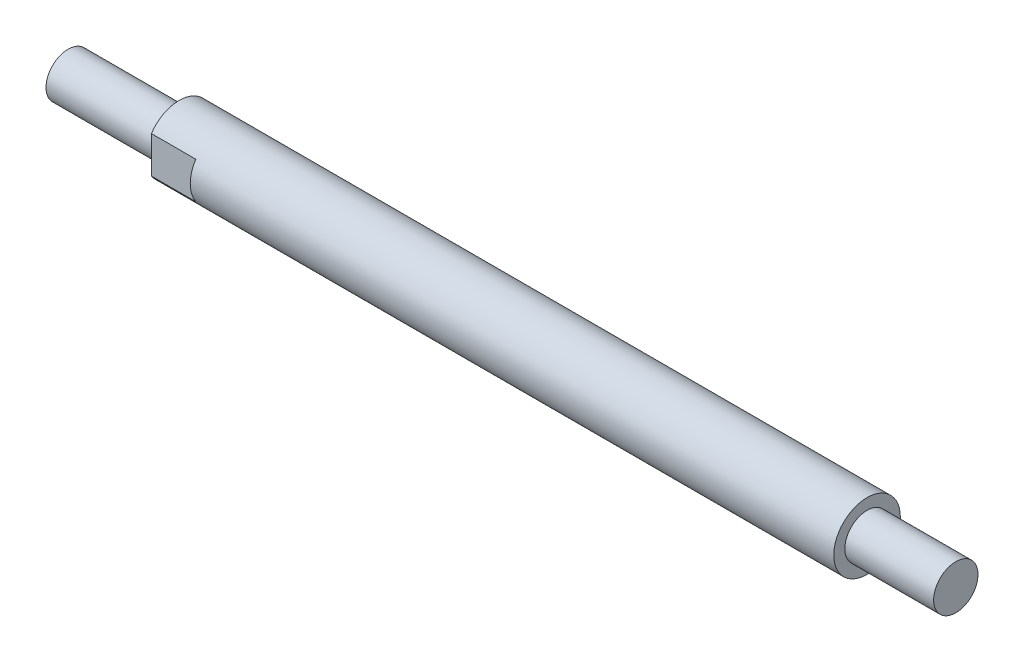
ISO-10303-21;
HEADER;
FILE_DESCRIPTION(('STEP AP214'),'2;1');
FILE_NAME('part.step','',(''),(''),'','','');
FILE_SCHEMA(('AUTOMOTIVE_DESIGN { 1 0 10303 214 1 1 1 1 }'));
ENDSEC;
DATA;
#1=APPLICATION_CONTEXT('core data for automotive mechanical design processes');
#2=APPLICATION_PROTOCOL_DEFINITION('international standard','automotive_design',2000,#1);
#3=PRODUCT_CONTEXT('',#1,'mechanical');
#4=PRODUCT('Part','Part','',(#3));
#5=PRODUCT_RELATED_PRODUCT_CATEGORY('part','',(#4));
#6=PRODUCT_DEFINITION_FORMATION('','',#4);
#7=PRODUCT_DEFINITION_CONTEXT('part definition',#1,'design');
#8=PRODUCT_DEFINITION('design','',#6,#7);
#9=PRODUCT_DEFINITION_SHAPE('','',#8);
#10=(LENGTH_UNIT() NAMED_UNIT(*) SI_UNIT(.MILLI.,.METRE.));
#11=(NAMED_UNIT(*) PLANE_ANGLE_UNIT() SI_UNIT($,.RADIAN.));
#12=(NAMED_UNIT(*) SI_UNIT($,.STERADIAN.) SOLID_ANGLE_UNIT());
#13=UNCERTAINTY_MEASURE_WITH_UNIT(LENGTH_MEASURE(1.E-05),#10,'distance_accuracy_value','');
#14=(GEOMETRIC_REPRESENTATION_CONTEXT(3) GLOBAL_UNCERTAINTY_ASSIGNED_CONTEXT((#13)) GLOBAL_UNIT_ASSIGNED_CONTEXT((#10,
#11,#12)) REPRESENTATION_CONTEXT('',''));
#15=CARTESIAN_POINT('',(0.,0.,0.));
#16=DIRECTION('',(0.,0.,1.));
#17=DIRECTION('',(1.,0.,0.));
#18=AXIS2_PLACEMENT_3D('',#15,#16,#17);
#19=CARTESIAN_POINT('',(114.3,0.,0.));
#20=DIRECTION('',(-1.,0.,0.));
#21=DIRECTION('',(0.,0.,1.));
#22=AXIS2_PLACEMENT_3D('',#19,#20,#21);
#23=CYLINDRICAL_SURFACE('',#22,4.7625);
#24=CARTESIAN_POINT('',(114.3,0.,0.));
#25=DIRECTION('',(1.,0.,0.));
#26=DIRECTION('',(0.,0.,-1.));
#27=AXIS2_PLACEMENT_3D('',#24,#25,#26);
#28=CIRCLE('',#27,4.7625);
#29=CARTESIAN_POINT('',(114.3,0.,-4.7625));
#30=VERTEX_POINT('',#29);
#31=EDGE_CURVE('E11',#30,#30,#28,.T.);
#32=ORIENTED_EDGE('',*,*,#31,.F.);
#33=EDGE_LOOP('',(#32));
#34=FACE_BOUND('',#33,.T.);
#35=CARTESIAN_POINT('',(22.225,0.,0.));
#36=DIRECTION('',(-1.,0.,0.));
#37=DIRECTION('',(0.,0.,1.));
#38=AXIS2_PLACEMENT_3D('',#35,#36,#37);
#39=CIRCLE('',#38,4.7625);
#40=CARTESIAN_POINT('',(22.225,-2.6325709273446,3.96875));
#41=VERTEX_POINT('',#40);
#42=CARTESIAN_POINT('',(22.225,2.6325709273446,3.96875));
#43=VERTEX_POINT('',#42);
#44=EDGE_CURVE('E76',#41,#43,#39,.T.);
#45=ORIENTED_EDGE('',*,*,#44,.F.);
#46=DIRECTION('',(-1.,0.,0.));
#47=VECTOR('',#46,1.);
#48=CARTESIAN_POINT('',(22.225,-2.6325709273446,3.96875));
#49=LINE('',#48,#47);
#50=CARTESIAN_POINT('',(15.875,-2.6325709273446,3.96875));
#51=VERTEX_POINT('',#50);
#52=EDGE_CURVE('E71',#41,#51,#49,.T.);
#53=ORIENTED_EDGE('',*,*,#52,.T.);
#54=CARTESIAN_POINT('',(15.875,0.,0.));
#55=DIRECTION('',(-1.,0.,0.));
#56=DIRECTION('',(0.,0.,1.));
#57=AXIS2_PLACEMENT_3D('',#54,#55,#56);
#58=CIRCLE('',#57,4.7625);
#59=CARTESIAN_POINT('',(15.875,-2.6325709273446,-3.96875));
#60=VERTEX_POINT('',#59);
#61=EDGE_CURVE('E81',#60,#51,#58,.T.);
#62=ORIENTED_EDGE('',*,*,#61,.F.);
#63=DIRECTION('',(-1.,0.,0.));
#64=VECTOR('',#63,1.);
#65=CARTESIAN_POINT('',(22.225,-2.6325709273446,-3.96875));
#66=LINE('',#65,#64);
#67=CARTESIAN_POINT('',(22.225,-2.6325709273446,-3.96875));
#68=VERTEX_POINT('',#67);
#69=EDGE_CURVE('E50',#68,#60,#66,.T.);
#70=ORIENTED_EDGE('',*,*,#69,.F.);
#71=CARTESIAN_POINT('',(22.225,0.,0.));
#72=DIRECTION('',(-1.,0.,0.));
#73=DIRECTION('',(0.,0.,1.));
#74=AXIS2_PLACEMENT_3D('',#71,#72,#73);
#75=CIRCLE('',#74,4.7625);
#76=CARTESIAN_POINT('',(22.225,2.6325709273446,-3.96875));
#77=VERTEX_POINT('',#76);
#78=EDGE_CURVE('E146',#77,#68,#75,.T.);
#79=ORIENTED_EDGE('',*,*,#78,.F.);
#80=DIRECTION('',(-1.,0.,0.));
#81=VECTOR('',#80,1.);
#82=CARTESIAN_POINT('',(22.225,2.6325709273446,-3.96875));
#83=LINE('',#82,#81);
#84=CARTESIAN_POINT('',(15.875,2.6325709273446,-3.96875));
#85=VERTEX_POINT('',#84);
#86=EDGE_CURVE('E151',#77,#85,#83,.T.);
#87=ORIENTED_EDGE('',*,*,#86,.T.);
#88=CARTESIAN_POINT('',(15.875,2.6325709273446,3.96875));
#89=VERTEX_POINT('',#88);
#90=EDGE_CURVE('E87',#89,#85,#58,.T.);
#91=ORIENTED_EDGE('',*,*,#90,.F.);
#92=DIRECTION('',(-1.,0.,0.));
#93=VECTOR('',#92,1.);
#94=CARTESIAN_POINT('',(22.225,2.6325709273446,3.96875));
#95=LINE('',#94,#93);
#96=EDGE_CURVE('E42',#43,#89,#95,.T.);
#97=ORIENTED_EDGE('',*,*,#96,.F.);
#98=EDGE_LOOP('',(#45,#53,#62,#70,#79,#87,#91,#97));
#99=FACE_BOUND('',#98,.T.);
#100=ADVANCED_FACE('F28',(#34,#99),#23,.T.);
#101=CARTESIAN_POINT('',(114.3,0.,0.));
#102=DIRECTION('',(1.,0.,0.));
#103=DIRECTION('',(0.,0.,-1.));
#104=AXIS2_PLACEMENT_3D('',#101,#102,#103);
#105=PLANE('',#104);
#106=ORIENTED_EDGE('',*,*,#31,.T.);
#107=EDGE_LOOP('',(#106));
#108=FACE_BOUND('',#107,.T.);
#109=CARTESIAN_POINT('',(114.3,0.,0.));
#110=DIRECTION('',(1.,0.,0.));
#111=DIRECTION('',(0.,0.,-1.));
#112=AXIS2_PLACEMENT_3D('',#109,#110,#111);
#113=CIRCLE('',#112,3.175);
#114=CARTESIAN_POINT('',(114.3,0.,-3.175));
#115=VERTEX_POINT('',#114);
#116=EDGE_CURVE('E86',#115,#115,#113,.T.);
#117=ORIENTED_EDGE('',*,*,#116,.F.);
#118=EDGE_LOOP('',(#117));
#119=FACE_BOUND('',#118,.T.);
#120=ADVANCED_FACE('F102',(#108,#119),#105,.T.);
#121=CARTESIAN_POINT('',(127.,0.,0.));
#122=DIRECTION('',(-1.,0.,0.));
#123=DIRECTION('',(0.,0.,1.));
#124=AXIS2_PLACEMENT_3D('',#121,#122,#123);
#125=CYLINDRICAL_SURFACE('',#124,3.175);
#126=CARTESIAN_POINT('',(127.,0.,0.));
#127=DIRECTION('',(1.,0.,0.));
#128=DIRECTION('',(0.,0.,-1.));
#129=AXIS2_PLACEMENT_3D('',#126,#127,#128);
#130=CIRCLE('',#129,3.175);
#131=CARTESIAN_POINT('',(127.,0.,-3.175));
#132=VERTEX_POINT('',#131);
#133=EDGE_CURVE('E35',#132,#132,#130,.T.);
#134=ORIENTED_EDGE('',*,*,#133,.F.);
#135=EDGE_LOOP('',(#134));
#136=FACE_BOUND('',#135,.T.);
#137=ORIENTED_EDGE('',*,*,#116,.T.);
#138=EDGE_LOOP('',(#137));
#139=FACE_BOUND('',#138,.T.);
#140=ADVANCED_FACE('F99',(#136,#139),#125,.T.);
#141=CARTESIAN_POINT('',(127.,0.,0.));
#142=DIRECTION('',(1.,0.,0.));
#143=DIRECTION('',(0.,0.,-1.));
#144=AXIS2_PLACEMENT_3D('',#141,#142,#143);
#145=PLANE('',#144);
#146=ORIENTED_EDGE('',*,*,#133,.T.);
#147=EDGE_LOOP('',(#146));
#148=FACE_BOUND('',#147,.T.);
#149=ADVANCED_FACE('F97',(#148),#145,.T.);
#150=CARTESIAN_POINT('',(15.875,0.,0.));
#151=DIRECTION('',(-1.,0.,0.));
#152=DIRECTION('',(0.,0.,1.));
#153=AXIS2_PLACEMENT_3D('',#150,#151,#152);
#154=PLANE('',#153);
#155=DIRECTION('',(0.,-1.,0.));
#156=VECTOR('',#155,1.);
#157=CARTESIAN_POINT('',(15.875,2.6325709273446,3.96875));
#158=LINE('',#157,#156);
#159=EDGE_CURVE('E68',#89,#51,#158,.T.);
#160=ORIENTED_EDGE('',*,*,#159,.F.);
#161=ORIENTED_EDGE('',*,*,#90,.T.);
#162=DIRECTION('',(0.,1.,0.));
#163=VECTOR('',#162,1.);
#164=CARTESIAN_POINT('',(15.875,-2.6325709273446,-3.96875));
#165=LINE('',#164,#163);
#166=EDGE_CURVE('E82',#60,#85,#165,.T.);
#167=ORIENTED_EDGE('',*,*,#166,.F.);
#168=ORIENTED_EDGE('',*,*,#61,.T.);
#169=EDGE_LOOP('',(#160,#161,#167,#168));
#170=FACE_BOUND('',#169,.T.);
#171=CARTESIAN_POINT('',(15.875,0.,0.));
#172=DIRECTION('',(-1.,0.,0.));
#173=DIRECTION('',(0.,0.,1.));
#174=AXIS2_PLACEMENT_3D('',#171,#172,#173);
#175=CIRCLE('',#174,3.175);
#176=CARTESIAN_POINT('',(15.875,0.,3.175));
#177=VERTEX_POINT('',#176);
#178=EDGE_CURVE('E91',#177,#177,#175,.T.);
#179=ORIENTED_EDGE('',*,*,#178,.F.);
#180=EDGE_LOOP('',(#179));
#181=FACE_BOUND('',#180,.T.);
#182=ADVANCED_FACE('F84',(#170,#181),#154,.T.);
#183=CARTESIAN_POINT('',(15.875,0.,0.));
#184=DIRECTION('',(-1.,0.,0.));
#185=DIRECTION('',(0.,0.,1.));
#186=AXIS2_PLACEMENT_3D('',#183,#184,#185);
#187=CYLINDRICAL_SURFACE('',#186,3.175);
#188=ORIENTED_EDGE('',*,*,#178,.T.);
#189=EDGE_LOOP('',(#188));
#190=FACE_BOUND('',#189,.T.);
#191=CARTESIAN_POINT('',(0.,0.,0.));
#192=DIRECTION('',(-1.,0.,0.));
#193=DIRECTION('',(0.,0.,1.));
#194=AXIS2_PLACEMENT_3D('',#191,#192,#193);
#195=CIRCLE('',#194,3.175);
#196=CARTESIAN_POINT('',(0.,0.,3.175));
#197=VERTEX_POINT('',#196);
#198=EDGE_CURVE('E153',#197,#197,#195,.T.);
#199=ORIENTED_EDGE('',*,*,#198,.F.);
#200=EDGE_LOOP('',(#199));
#201=FACE_BOUND('',#200,.T.);
#202=ADVANCED_FACE('F116',(#190,#201),#187,.T.);
#203=CARTESIAN_POINT('',(0.,0.,0.));
#204=DIRECTION('',(1.,0.,0.));
#205=DIRECTION('',(0.,0.,-1.));
#206=AXIS2_PLACEMENT_3D('',#203,#204,#205);
#207=PLANE('',#206);
#208=ORIENTED_EDGE('',*,*,#198,.T.);
#209=EDGE_LOOP('',(#208));
#210=FACE_BOUND('',#209,.T.);
#211=ADVANCED_FACE('F113',(#210),#207,.F.);
#212=CARTESIAN_POINT('',(22.225,-2.6325709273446,-3.96875));
#213=DIRECTION('',(0.,0.,1.));
#214=DIRECTION('',(0.,-1.,0.));
#215=AXIS2_PLACEMENT_3D('',#212,#213,#214);
#216=PLANE('',#215);
#217=ORIENTED_EDGE('',*,*,#166,.T.);
#218=ORIENTED_EDGE('',*,*,#86,.F.);
#219=DIRECTION('',(0.,1.,0.));
#220=VECTOR('',#219,1.);
#221=CARTESIAN_POINT('',(22.225,-2.6325709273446,-3.96875));
#222=LINE('',#221,#220);
#223=EDGE_CURVE('E148',#68,#77,#222,.T.);
#224=ORIENTED_EDGE('',*,*,#223,.F.);
#225=ORIENTED_EDGE('',*,*,#69,.T.);
#226=EDGE_LOOP('',(#217,#218,#224,#225));
#227=FACE_BOUND('',#226,.T.);
#228=ADVANCED_FACE('F115',(#227),#216,.F.);
#229=CARTESIAN_POINT('',(22.225,0.,0.));
#230=DIRECTION('',(-1.,0.,0.));
#231=DIRECTION('',(0.,0.,1.));
#232=AXIS2_PLACEMENT_3D('',#229,#230,#231);
#233=PLANE('',#232);
#234=ORIENTED_EDGE('',*,*,#78,.T.);
#235=ORIENTED_EDGE('',*,*,#223,.T.);
#236=EDGE_LOOP('',(#234,#235));
#237=FACE_BOUND('',#236,.T.);
#238=ADVANCED_FACE('F128',(#237),#233,.T.);
#239=CARTESIAN_POINT('',(22.225,2.6325709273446,3.96875));
#240=DIRECTION('',(0.,0.,-1.));
#241=DIRECTION('',(-1.,0.,0.));
#242=AXIS2_PLACEMENT_3D('',#239,#240,#241);
#243=PLANE('',#242);
#244=ORIENTED_EDGE('',*,*,#159,.T.);
#245=ORIENTED_EDGE('',*,*,#52,.F.);
#246=DIRECTION('',(0.,-1.,0.));
#247=VECTOR('',#246,1.);
#248=CARTESIAN_POINT('',(22.225,2.6325709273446,3.96875));
#249=LINE('',#248,#247);
#250=EDGE_CURVE('E139',#43,#41,#249,.T.);
#251=ORIENTED_EDGE('',*,*,#250,.F.);
#252=ORIENTED_EDGE('',*,*,#96,.T.);
#253=EDGE_LOOP('',(#244,#245,#251,#252));
#254=FACE_BOUND('',#253,.T.);
#255=ADVANCED_FACE('F70',(#254),#243,.F.);
#256=CARTESIAN_POINT('',(22.225,0.,0.));
#257=DIRECTION('',(-1.,0.,0.));
#258=DIRECTION('',(0.,0.,1.));
#259=AXIS2_PLACEMENT_3D('',#256,#257,#258);
#260=PLANE('',#259);
#261=ORIENTED_EDGE('',*,*,#44,.T.);
#262=ORIENTED_EDGE('',*,*,#250,.T.);
#263=EDGE_LOOP('',(#261,#262));
#264=FACE_BOUND('',#263,.T.);
#265=ADVANCED_FACE('F134',(#264),#260,.T.);
#266=CLOSED_SHELL('',(#100,#120,#140,#149,#182,#202,#211,#228,#238,#255,#265));
#267=MANIFOLD_SOLID_BREP('B2',#266);
#268=ADVANCED_BREP_SHAPE_REPRESENTATION('',(#18,#267),#14);
#269=SHAPE_DEFINITION_REPRESENTATION(#9,#268);
ENDSEC;
END-ISO-10303-21;
